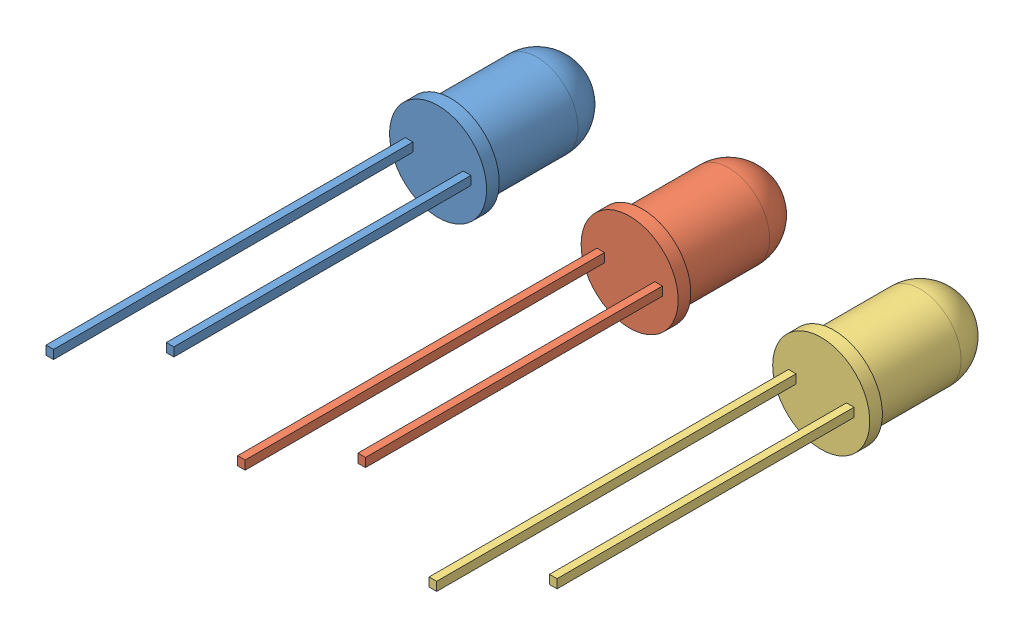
SolidWorks assembly Assem5.SLDASM, configuration Default (file format 8000). Lengths in mm.
Overall size (38.09 8.43 39.59).
3 component instances, 3 part files, 6 mates.
Components (placement in the parent):
- led-1: led.SLDPRT [Default] at (-2.4504 3.85 45.7472) size (7.7 7.7 39.59)
- led green-1: led green.SLDPRT [Default] at (12.7431 3.85 45.7472) size (7.7 7.7 39.59)
- led yellow-1: led yellow.SLDPRT [Default] at (27.9367 3.1196 45.7472) size (7.7 7.7 39.59)
Mates (geometry in assembly coordinates):
- Coincident1: coincident aligned: plane of led-1 through (-0.4554 3.85 17.2472) normal (0 0 1); plane of led green-1 through (14.7381 8.159 17.2472) normal (0 0 1)
- Coincident2: coincident aligned: plane of led green-1 through (14.7381 8.159 17.2472) normal (0 0 1); plane of led yellow-1 through (29.9317 3.1196 17.2472) normal (0 0 1)
- Distance1: distance = 10 mm anti-aligned: plane of led-1 through (2.1431 4.2 40.7987) normal (1 0 0); plane of led green-1 through (12.1431 4.2 45.7472) normal (-1 0 0)
- Distance2: distance = 10 mm anti-aligned: plane of led yellow-1 through (27.3367 3.4696 45.7472) normal (-1 0 0); plane of led green-1 through (17.3367 4.2 40.7987) normal (1 0 0)
- Tangent5: tangent anti-aligned: cylinder of led-1 through (-0.4554 3.85 7.1048) axis (0 0 -1) radius 3.85; plane of assembly
- Tangent6: tangent anti-aligned: cylinder of led green-1 through (14.7381 3.85 7.1048) axis (0 0 -1) radius 3.85; plane of assembly
